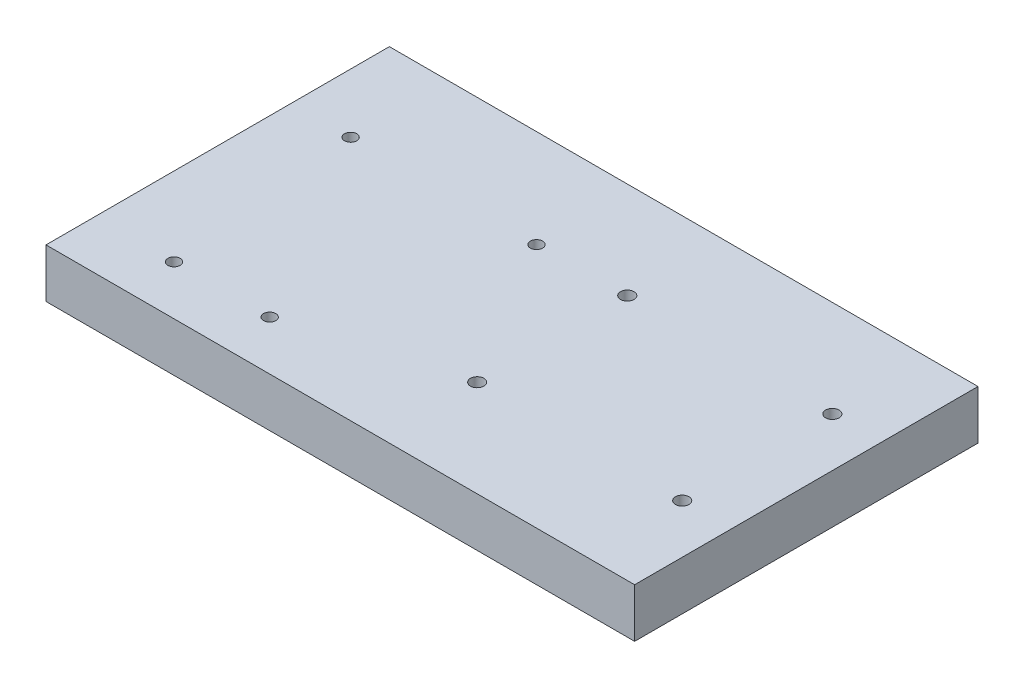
ISO-10303-21;
HEADER;
FILE_DESCRIPTION(('STEP AP214'),'2;1');
FILE_NAME('part.step','',(''),(''),'','','');
FILE_SCHEMA(('AUTOMOTIVE_DESIGN { 1 0 10303 214 1 1 1 1 }'));
ENDSEC;
DATA;
#1=APPLICATION_CONTEXT('core data for automotive mechanical design processes');
#2=APPLICATION_PROTOCOL_DEFINITION('international standard','automotive_design',2000,#1);
#3=PRODUCT_CONTEXT('',#1,'mechanical');
#4=PRODUCT('Part','Part','',(#3));
#5=PRODUCT_RELATED_PRODUCT_CATEGORY('part','',(#4));
#6=PRODUCT_DEFINITION_FORMATION('','',#4);
#7=PRODUCT_DEFINITION_CONTEXT('part definition',#1,'design');
#8=PRODUCT_DEFINITION('design','',#6,#7);
#9=PRODUCT_DEFINITION_SHAPE('','',#8);
#10=(LENGTH_UNIT() NAMED_UNIT(*) SI_UNIT(.MILLI.,.METRE.));
#11=(NAMED_UNIT(*) PLANE_ANGLE_UNIT() SI_UNIT($,.RADIAN.));
#12=(NAMED_UNIT(*) SI_UNIT($,.STERADIAN.) SOLID_ANGLE_UNIT());
#13=UNCERTAINTY_MEASURE_WITH_UNIT(LENGTH_MEASURE(1.E-05),#10,'distance_accuracy_value','');
#14=(GEOMETRIC_REPRESENTATION_CONTEXT(3) GLOBAL_UNCERTAINTY_ASSIGNED_CONTEXT((#13)) GLOBAL_UNIT_ASSIGNED_CONTEXT((#10,
#11,#12)) REPRESENTATION_CONTEXT('',''));
#15=CARTESIAN_POINT('',(0.,0.,0.));
#16=DIRECTION('',(0.,0.,1.));
#17=DIRECTION('',(1.,0.,0.));
#18=AXIS2_PLACEMENT_3D('',#15,#16,#17);
#19=CARTESIAN_POINT('',(76.2,12.7,44.45));
#20=DIRECTION('',(-1.,0.,0.));
#21=DIRECTION('',(0.,0.,1.));
#22=AXIS2_PLACEMENT_3D('',#19,#20,#21);
#23=PLANE('',#22);
#24=DIRECTION('',(0.,0.,-1.));
#25=VECTOR('',#24,1.);
#26=CARTESIAN_POINT('',(76.2,0.,44.45));
#27=LINE('',#26,#25);
#28=CARTESIAN_POINT('',(76.2,0.,44.45));
#29=VERTEX_POINT('',#28);
#30=CARTESIAN_POINT('',(76.2,0.,-44.45));
#31=VERTEX_POINT('',#30);
#32=EDGE_CURVE('E96',#29,#31,#27,.T.);
#33=ORIENTED_EDGE('',*,*,#32,.T.);
#34=DIRECTION('',(0.,-1.,0.));
#35=VECTOR('',#34,1.);
#36=CARTESIAN_POINT('',(76.2,12.7,-44.45));
#37=LINE('',#36,#35);
#38=CARTESIAN_POINT('',(76.2,12.7,-44.45));
#39=VERTEX_POINT('',#38);
#40=EDGE_CURVE('E11',#39,#31,#37,.T.);
#41=ORIENTED_EDGE('',*,*,#40,.F.);
#42=DIRECTION('',(0.,0.,-1.));
#43=VECTOR('',#42,1.);
#44=CARTESIAN_POINT('',(76.2,12.7,44.45));
#45=LINE('',#44,#43);
#46=CARTESIAN_POINT('',(76.2,12.7,44.45));
#47=VERTEX_POINT('',#46);
#48=EDGE_CURVE('E84',#47,#39,#45,.T.);
#49=ORIENTED_EDGE('',*,*,#48,.F.);
#50=DIRECTION('',(0.,-1.,0.));
#51=VECTOR('',#50,1.);
#52=CARTESIAN_POINT('',(76.2,12.7,44.45));
#53=LINE('',#52,#51);
#54=EDGE_CURVE('E92',#47,#29,#53,.T.);
#55=ORIENTED_EDGE('',*,*,#54,.T.);
#56=EDGE_LOOP('',(#33,#41,#49,#55));
#57=FACE_BOUND('',#56,.T.);
#58=ADVANCED_FACE('F33',(#57),#23,.F.);
#59=CARTESIAN_POINT('',(-76.2,12.7,-44.45));
#60=DIRECTION('',(0.,0.,1.));
#61=DIRECTION('',(1.,0.,0.));
#62=AXIS2_PLACEMENT_3D('',#59,#60,#61);
#63=PLANE('',#62);
#64=DIRECTION('',(-1.,0.,0.));
#65=VECTOR('',#64,1.);
#66=CARTESIAN_POINT('',(-76.2,0.,-44.45));
#67=LINE('',#66,#65);
#68=CARTESIAN_POINT('',(-76.2,0.,-44.45));
#69=VERTEX_POINT('',#68);
#70=EDGE_CURVE('E88',#31,#69,#67,.T.);
#71=ORIENTED_EDGE('',*,*,#70,.T.);
#72=DIRECTION('',(0.,-1.,0.));
#73=VECTOR('',#72,1.);
#74=CARTESIAN_POINT('',(-76.2,12.7,-44.45));
#75=LINE('',#74,#73);
#76=CARTESIAN_POINT('',(-76.2,12.7,-44.45));
#77=VERTEX_POINT('',#76);
#78=EDGE_CURVE('E41',#77,#69,#75,.T.);
#79=ORIENTED_EDGE('',*,*,#78,.F.);
#80=DIRECTION('',(-1.,0.,0.));
#81=VECTOR('',#80,1.);
#82=CARTESIAN_POINT('',(-76.2,12.7,-44.45));
#83=LINE('',#82,#81);
#84=EDGE_CURVE('E79',#39,#77,#83,.T.);
#85=ORIENTED_EDGE('',*,*,#84,.F.);
#86=ORIENTED_EDGE('',*,*,#40,.T.);
#87=EDGE_LOOP('',(#71,#79,#85,#86));
#88=FACE_BOUND('',#87,.T.);
#89=ADVANCED_FACE('F87',(#88),#63,.F.);
#90=CARTESIAN_POINT('',(-76.2,12.7,44.45));
#91=DIRECTION('',(1.,0.,0.));
#92=DIRECTION('',(0.,0.,-1.));
#93=AXIS2_PLACEMENT_3D('',#90,#91,#92);
#94=PLANE('',#93);
#95=DIRECTION('',(0.,0.,1.));
#96=VECTOR('',#95,1.);
#97=CARTESIAN_POINT('',(-76.2,0.,44.45));
#98=LINE('',#97,#96);
#99=CARTESIAN_POINT('',(-76.2,0.,44.45));
#100=VERTEX_POINT('',#99);
#101=EDGE_CURVE('E66',#69,#100,#98,.T.);
#102=ORIENTED_EDGE('',*,*,#101,.T.);
#103=DIRECTION('',(0.,-1.,0.));
#104=VECTOR('',#103,1.);
#105=CARTESIAN_POINT('',(-76.2,12.7,44.45));
#106=LINE('',#105,#104);
#107=CARTESIAN_POINT('',(-76.2,12.7,44.45));
#108=VERTEX_POINT('',#107);
#109=EDGE_CURVE('E89',#108,#100,#106,.T.);
#110=ORIENTED_EDGE('',*,*,#109,.F.);
#111=DIRECTION('',(0.,0.,1.));
#112=VECTOR('',#111,1.);
#113=CARTESIAN_POINT('',(-76.2,12.7,44.45));
#114=LINE('',#113,#112);
#115=EDGE_CURVE('E82',#77,#108,#114,.T.);
#116=ORIENTED_EDGE('',*,*,#115,.F.);
#117=ORIENTED_EDGE('',*,*,#78,.T.);
#118=EDGE_LOOP('',(#102,#110,#116,#117));
#119=FACE_BOUND('',#118,.T.);
#120=ADVANCED_FACE('F90',(#119),#94,.F.);
#121=CARTESIAN_POINT('',(-76.2,12.7,44.45));
#122=DIRECTION('',(0.,0.,-1.));
#123=DIRECTION('',(-1.,0.,0.));
#124=AXIS2_PLACEMENT_3D('',#121,#122,#123);
#125=PLANE('',#124);
#126=DIRECTION('',(1.,0.,0.));
#127=VECTOR('',#126,1.);
#128=CARTESIAN_POINT('',(-76.2,0.,44.45));
#129=LINE('',#128,#127);
#130=EDGE_CURVE('E72',#100,#29,#129,.T.);
#131=ORIENTED_EDGE('',*,*,#130,.T.);
#132=ORIENTED_EDGE('',*,*,#54,.F.);
#133=DIRECTION('',(1.,0.,0.));
#134=VECTOR('',#133,1.);
#135=CARTESIAN_POINT('',(-76.2,12.7,44.45));
#136=LINE('',#135,#134);
#137=EDGE_CURVE('E49',#108,#47,#136,.T.);
#138=ORIENTED_EDGE('',*,*,#137,.F.);
#139=ORIENTED_EDGE('',*,*,#109,.T.);
#140=EDGE_LOOP('',(#131,#132,#138,#139));
#141=FACE_BOUND('',#140,.T.);
#142=ADVANCED_FACE('F104',(#141),#125,.F.);
#143=CARTESIAN_POINT('',(0.,12.7,0.));
#144=DIRECTION('',(0.,-1.,0.));
#145=DIRECTION('',(0.,0.,-1.));
#146=AXIS2_PLACEMENT_3D('',#143,#144,#145);
#147=PLANE('',#146);
#148=CARTESIAN_POINT('',(-55.8165,12.7,31.6865));
#149=DIRECTION('',(0.,1.,0.));
#150=DIRECTION('',(0.,0.,-1.));
#151=AXIS2_PLACEMENT_3D('',#148,#149,#150);
#152=CIRCLE('',#151,1.5875);
#153=CARTESIAN_POINT('',(-55.8165,12.7,30.099));
#154=VERTEX_POINT('',#153);
#155=EDGE_CURVE('E152',#154,#154,#152,.T.);
#156=ORIENTED_EDGE('',*,*,#155,.F.);
#157=EDGE_LOOP('',(#156));
#158=FACE_BOUND('',#157,.T.);
#159=CARTESIAN_POINT('',(-31.0515,12.7,31.6865));
#160=DIRECTION('',(0.,1.,0.));
#161=DIRECTION('',(0.,0.,-1.));
#162=AXIS2_PLACEMENT_3D('',#159,#160,#161);
#163=CIRCLE('',#162,1.5875);
#164=CARTESIAN_POINT('',(-31.0515,12.7,30.099));
#165=VERTEX_POINT('',#164);
#166=EDGE_CURVE('E146',#165,#165,#163,.T.);
#167=ORIENTED_EDGE('',*,*,#166,.F.);
#168=EDGE_LOOP('',(#167));
#169=FACE_BOUND('',#168,.T.);
#170=CARTESIAN_POINT('',(-60.8965,12.7,-19.1135));
#171=DIRECTION('',(0.,1.,0.));
#172=DIRECTION('',(0.,0.,1.));
#173=AXIS2_PLACEMENT_3D('',#170,#171,#172);
#174=CIRCLE('',#173,1.5875);
#175=CARTESIAN_POINT('',(-60.8965,12.7,-17.526));
#176=VERTEX_POINT('',#175);
#177=EDGE_CURVE('E140',#176,#176,#174,.T.);
#178=ORIENTED_EDGE('',*,*,#177,.F.);
#179=EDGE_LOOP('',(#178));
#180=FACE_BOUND('',#179,.T.);
#181=CARTESIAN_POINT('',(-12.7635,12.7,-19.1135));
#182=DIRECTION('',(0.,1.,0.));
#183=DIRECTION('',(0.,0.,1.));
#184=AXIS2_PLACEMENT_3D('',#181,#182,#183);
#185=CIRCLE('',#184,1.5875);
#186=CARTESIAN_POINT('',(-12.7635,12.7,-17.526));
#187=VERTEX_POINT('',#186);
#188=EDGE_CURVE('E134',#187,#187,#185,.T.);
#189=ORIENTED_EDGE('',*,*,#188,.F.);
#190=EDGE_LOOP('',(#189));
#191=FACE_BOUND('',#190,.T.);
#192=CARTESIAN_POINT('',(63.5,12.7,-19.431));
#193=DIRECTION('',(0.,1.,0.));
#194=DIRECTION('',(0.,0.,1.));
#195=AXIS2_PLACEMENT_3D('',#192,#193,#194);
#196=CIRCLE('',#195,1.75259999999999);
#197=CARTESIAN_POINT('',(63.5,12.7,-17.6784));
#198=VERTEX_POINT('',#197);
#199=EDGE_CURVE('E130',#198,#198,#196,.T.);
#200=ORIENTED_EDGE('',*,*,#199,.F.);
#201=EDGE_LOOP('',(#200));
#202=FACE_BOUND('',#201,.T.);
#203=CARTESIAN_POINT('',(63.5,12.7,19.431));
#204=DIRECTION('',(0.,1.,0.));
#205=DIRECTION('',(0.,0.,1.));
#206=AXIS2_PLACEMENT_3D('',#203,#204,#205);
#207=CIRCLE('',#206,1.75259999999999);
#208=CARTESIAN_POINT('',(63.5,12.7,21.1836));
#209=VERTEX_POINT('',#208);
#210=EDGE_CURVE('E124',#209,#209,#207,.T.);
#211=ORIENTED_EDGE('',*,*,#210,.F.);
#212=EDGE_LOOP('',(#211));
#213=FACE_BOUND('',#212,.T.);
#214=CARTESIAN_POINT('',(10.414,12.7,-19.431));
#215=DIRECTION('',(0.,1.,0.));
#216=DIRECTION('',(0.,0.,1.));
#217=AXIS2_PLACEMENT_3D('',#214,#215,#216);
#218=CIRCLE('',#217,1.75259999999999);
#219=CARTESIAN_POINT('',(10.414,12.7,-17.6784));
#220=VERTEX_POINT('',#219);
#221=EDGE_CURVE('E118',#220,#220,#218,.T.);
#222=ORIENTED_EDGE('',*,*,#221,.F.);
#223=EDGE_LOOP('',(#222));
#224=FACE_BOUND('',#223,.T.);
#225=CARTESIAN_POINT('',(10.414,12.7,19.431));
#226=DIRECTION('',(0.,1.,0.));
#227=DIRECTION('',(0.,0.,1.));
#228=AXIS2_PLACEMENT_3D('',#225,#226,#227);
#229=CIRCLE('',#228,1.75259999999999);
#230=CARTESIAN_POINT('',(10.414,12.7,21.1836));
#231=VERTEX_POINT('',#230);
#232=EDGE_CURVE('E112',#231,#231,#229,.T.);
#233=ORIENTED_EDGE('',*,*,#232,.F.);
#234=EDGE_LOOP('',(#233));
#235=FACE_BOUND('',#234,.T.);
#236=ORIENTED_EDGE('',*,*,#48,.T.);
#237=ORIENTED_EDGE('',*,*,#84,.T.);
#238=ORIENTED_EDGE('',*,*,#115,.T.);
#239=ORIENTED_EDGE('',*,*,#137,.T.);
#240=EDGE_LOOP('',(#236,#237,#238,#239));
#241=FACE_BOUND('',#240,.T.);
#242=ADVANCED_FACE('F80',(#158,#169,#180,#191,#202,#213,#224,#235,#241),#147,.F.);
#243=CARTESIAN_POINT('',(0.,0.,0.));
#244=DIRECTION('',(0.,-1.,0.));
#245=DIRECTION('',(0.,0.,-1.));
#246=AXIS2_PLACEMENT_3D('',#243,#244,#245);
#247=PLANE('',#246);
#248=CARTESIAN_POINT('',(-55.8165,0.,31.6865));
#249=DIRECTION('',(0.,1.,0.));
#250=DIRECTION('',(0.,0.,-1.));
#251=AXIS2_PLACEMENT_3D('',#248,#249,#250);
#252=CIRCLE('',#251,1.5875);
#253=CARTESIAN_POINT('',(-55.8165,0.,30.099));
#254=VERTEX_POINT('',#253);
#255=EDGE_CURVE('E149',#254,#254,#252,.T.);
#256=ORIENTED_EDGE('',*,*,#255,.T.);
#257=EDGE_LOOP('',(#256));
#258=FACE_BOUND('',#257,.T.);
#259=CARTESIAN_POINT('',(-31.0515,0.,31.6865));
#260=DIRECTION('',(0.,1.,0.));
#261=DIRECTION('',(0.,0.,-1.));
#262=AXIS2_PLACEMENT_3D('',#259,#260,#261);
#263=CIRCLE('',#262,1.5875);
#264=CARTESIAN_POINT('',(-31.0515,0.,30.099));
#265=VERTEX_POINT('',#264);
#266=EDGE_CURVE('E143',#265,#265,#263,.T.);
#267=ORIENTED_EDGE('',*,*,#266,.T.);
#268=EDGE_LOOP('',(#267));
#269=FACE_BOUND('',#268,.T.);
#270=CARTESIAN_POINT('',(-60.8965,0.,-19.1135));
#271=DIRECTION('',(0.,1.,0.));
#272=DIRECTION('',(0.,0.,1.));
#273=AXIS2_PLACEMENT_3D('',#270,#271,#272);
#274=CIRCLE('',#273,1.5875);
#275=CARTESIAN_POINT('',(-60.8965,0.,-17.526));
#276=VERTEX_POINT('',#275);
#277=EDGE_CURVE('E137',#276,#276,#274,.T.);
#278=ORIENTED_EDGE('',*,*,#277,.T.);
#279=EDGE_LOOP('',(#278));
#280=FACE_BOUND('',#279,.T.);
#281=CARTESIAN_POINT('',(-12.7635,0.,-19.1135));
#282=DIRECTION('',(0.,1.,0.));
#283=DIRECTION('',(0.,0.,1.));
#284=AXIS2_PLACEMENT_3D('',#281,#282,#283);
#285=CIRCLE('',#284,1.5875);
#286=CARTESIAN_POINT('',(-12.7635,0.,-17.526));
#287=VERTEX_POINT('',#286);
#288=EDGE_CURVE('E133',#287,#287,#285,.T.);
#289=ORIENTED_EDGE('',*,*,#288,.T.);
#290=EDGE_LOOP('',(#289));
#291=FACE_BOUND('',#290,.T.);
#292=CARTESIAN_POINT('',(63.5,0.,-19.431));
#293=DIRECTION('',(0.,1.,0.));
#294=DIRECTION('',(0.,0.,1.));
#295=AXIS2_PLACEMENT_3D('',#292,#293,#294);
#296=CIRCLE('',#295,1.75259999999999);
#297=CARTESIAN_POINT('',(63.5,0.,-17.6784));
#298=VERTEX_POINT('',#297);
#299=EDGE_CURVE('E127',#298,#298,#296,.T.);
#300=ORIENTED_EDGE('',*,*,#299,.T.);
#301=EDGE_LOOP('',(#300));
#302=FACE_BOUND('',#301,.T.);
#303=CARTESIAN_POINT('',(63.5,0.,19.431));
#304=DIRECTION('',(0.,1.,0.));
#305=DIRECTION('',(0.,0.,1.));
#306=AXIS2_PLACEMENT_3D('',#303,#304,#305);
#307=CIRCLE('',#306,1.75259999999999);
#308=CARTESIAN_POINT('',(63.5,0.,21.1836));
#309=VERTEX_POINT('',#308);
#310=EDGE_CURVE('E121',#309,#309,#307,.T.);
#311=ORIENTED_EDGE('',*,*,#310,.T.);
#312=EDGE_LOOP('',(#311));
#313=FACE_BOUND('',#312,.T.);
#314=CARTESIAN_POINT('',(10.414,0.,-19.431));
#315=DIRECTION('',(0.,1.,0.));
#316=DIRECTION('',(0.,0.,1.));
#317=AXIS2_PLACEMENT_3D('',#314,#315,#316);
#318=CIRCLE('',#317,1.7526);
#319=CARTESIAN_POINT('',(10.414,0.,-17.6784));
#320=VERTEX_POINT('',#319);
#321=EDGE_CURVE('E115',#320,#320,#318,.T.);
#322=ORIENTED_EDGE('',*,*,#321,.T.);
#323=EDGE_LOOP('',(#322));
#324=FACE_BOUND('',#323,.T.);
#325=CARTESIAN_POINT('',(10.414,0.,19.431));
#326=DIRECTION('',(0.,1.,0.));
#327=DIRECTION('',(0.,0.,1.));
#328=AXIS2_PLACEMENT_3D('',#325,#326,#327);
#329=CIRCLE('',#328,1.7526);
#330=CARTESIAN_POINT('',(10.414,0.,21.1836));
#331=VERTEX_POINT('',#330);
#332=EDGE_CURVE('E99',#331,#331,#329,.T.);
#333=ORIENTED_EDGE('',*,*,#332,.T.);
#334=EDGE_LOOP('',(#333));
#335=FACE_BOUND('',#334,.T.);
#336=ORIENTED_EDGE('',*,*,#32,.F.);
#337=ORIENTED_EDGE('',*,*,#130,.F.);
#338=ORIENTED_EDGE('',*,*,#101,.F.);
#339=ORIENTED_EDGE('',*,*,#70,.F.);
#340=EDGE_LOOP('',(#336,#337,#338,#339));
#341=FACE_BOUND('',#340,.T.);
#342=ADVANCED_FACE('F107',(#258,#269,#280,#291,#302,#313,#324,#335,#341),#247,.T.);
#343=CARTESIAN_POINT('',(10.414,12.7,19.431));
#344=DIRECTION('',(0.,1.,0.));
#345=DIRECTION('',(0.,0.,1.));
#346=AXIS2_PLACEMENT_3D('',#343,#344,#345);
#347=CYLINDRICAL_SURFACE('',#346,1.75259999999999);
#348=ORIENTED_EDGE('',*,*,#332,.F.);
#349=EDGE_LOOP('',(#348));
#350=FACE_BOUND('',#349,.T.);
#351=ORIENTED_EDGE('',*,*,#232,.T.);
#352=EDGE_LOOP('',(#351));
#353=FACE_BOUND('',#352,.T.);
#354=ADVANCED_FACE('F184',(#350,#353),#347,.F.);
#355=CARTESIAN_POINT('',(10.414,12.7,-19.431));
#356=DIRECTION('',(0.,1.,0.));
#357=DIRECTION('',(0.,0.,1.));
#358=AXIS2_PLACEMENT_3D('',#355,#356,#357);
#359=CYLINDRICAL_SURFACE('',#358,1.75259999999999);
#360=ORIENTED_EDGE('',*,*,#321,.F.);
#361=EDGE_LOOP('',(#360));
#362=FACE_BOUND('',#361,.T.);
#363=ORIENTED_EDGE('',*,*,#221,.T.);
#364=EDGE_LOOP('',(#363));
#365=FACE_BOUND('',#364,.T.);
#366=ADVANCED_FACE('F186',(#362,#365),#359,.F.);
#367=CARTESIAN_POINT('',(63.5,12.7,19.431));
#368=DIRECTION('',(0.,1.,0.));
#369=DIRECTION('',(0.,0.,1.));
#370=AXIS2_PLACEMENT_3D('',#367,#368,#369);
#371=CYLINDRICAL_SURFACE('',#370,1.75259999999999);
#372=ORIENTED_EDGE('',*,*,#310,.F.);
#373=EDGE_LOOP('',(#372));
#374=FACE_BOUND('',#373,.T.);
#375=ORIENTED_EDGE('',*,*,#210,.T.);
#376=EDGE_LOOP('',(#375));
#377=FACE_BOUND('',#376,.T.);
#378=ADVANCED_FACE('F193',(#374,#377),#371,.F.);
#379=CARTESIAN_POINT('',(63.5,12.7,-19.431));
#380=DIRECTION('',(0.,1.,0.));
#381=DIRECTION('',(0.,0.,1.));
#382=AXIS2_PLACEMENT_3D('',#379,#380,#381);
#383=CYLINDRICAL_SURFACE('',#382,1.75259999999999);
#384=ORIENTED_EDGE('',*,*,#299,.F.);
#385=EDGE_LOOP('',(#384));
#386=FACE_BOUND('',#385,.T.);
#387=ORIENTED_EDGE('',*,*,#199,.T.);
#388=EDGE_LOOP('',(#387));
#389=FACE_BOUND('',#388,.T.);
#390=ADVANCED_FACE('F233',(#386,#389),#383,.F.);
#391=CARTESIAN_POINT('',(-12.7635,0.,-19.1135));
#392=DIRECTION('',(0.,1.,0.));
#393=DIRECTION('',(0.,0.,1.));
#394=AXIS2_PLACEMENT_3D('',#391,#392,#393);
#395=CYLINDRICAL_SURFACE('',#394,1.5875);
#396=ORIENTED_EDGE('',*,*,#288,.F.);
#397=EDGE_LOOP('',(#396));
#398=FACE_BOUND('',#397,.T.);
#399=ORIENTED_EDGE('',*,*,#188,.T.);
#400=EDGE_LOOP('',(#399));
#401=FACE_BOUND('',#400,.T.);
#402=ADVANCED_FACE('F227',(#398,#401),#395,.F.);
#403=CARTESIAN_POINT('',(-60.8965,0.,-19.1135));
#404=DIRECTION('',(0.,1.,0.));
#405=DIRECTION('',(0.,0.,1.));
#406=AXIS2_PLACEMENT_3D('',#403,#404,#405);
#407=CYLINDRICAL_SURFACE('',#406,1.5875);
#408=ORIENTED_EDGE('',*,*,#277,.F.);
#409=EDGE_LOOP('',(#408));
#410=FACE_BOUND('',#409,.T.);
#411=ORIENTED_EDGE('',*,*,#177,.T.);
#412=EDGE_LOOP('',(#411));
#413=FACE_BOUND('',#412,.T.);
#414=ADVANCED_FACE('F232',(#410,#413),#407,.F.);
#415=CARTESIAN_POINT('',(-31.0515,0.,31.6865));
#416=DIRECTION('',(0.,1.,0.));
#417=DIRECTION('',(0.,0.,1.));
#418=AXIS2_PLACEMENT_3D('',#415,#416,#417);
#419=CYLINDRICAL_SURFACE('',#418,1.5875);
#420=ORIENTED_EDGE('',*,*,#266,.F.);
#421=EDGE_LOOP('',(#420));
#422=FACE_BOUND('',#421,.T.);
#423=ORIENTED_EDGE('',*,*,#166,.T.);
#424=EDGE_LOOP('',(#423));
#425=FACE_BOUND('',#424,.T.);
#426=ADVANCED_FACE('F163',(#422,#425),#419,.F.);
#427=CARTESIAN_POINT('',(-55.8165,0.,31.6865));
#428=DIRECTION('',(0.,1.,0.));
#429=DIRECTION('',(0.,0.,1.));
#430=AXIS2_PLACEMENT_3D('',#427,#428,#429);
#431=CYLINDRICAL_SURFACE('',#430,1.5875);
#432=ORIENTED_EDGE('',*,*,#255,.F.);
#433=EDGE_LOOP('',(#432));
#434=FACE_BOUND('',#433,.T.);
#435=ORIENTED_EDGE('',*,*,#155,.T.);
#436=EDGE_LOOP('',(#435));
#437=FACE_BOUND('',#436,.T.);
#438=ADVANCED_FACE('F160',(#434,#437),#431,.F.);
#439=CLOSED_SHELL('',(#58,#89,#120,#142,#242,#342,#354,#366,#378,#390,#402,#414,#426,#438));
#440=MANIFOLD_SOLID_BREP('B2',#439);
#441=ADVANCED_BREP_SHAPE_REPRESENTATION('',(#18,#440),#14);
#442=SHAPE_DEFINITION_REPRESENTATION(#9,#441);
ENDSEC;
END-ISO-10303-21;
